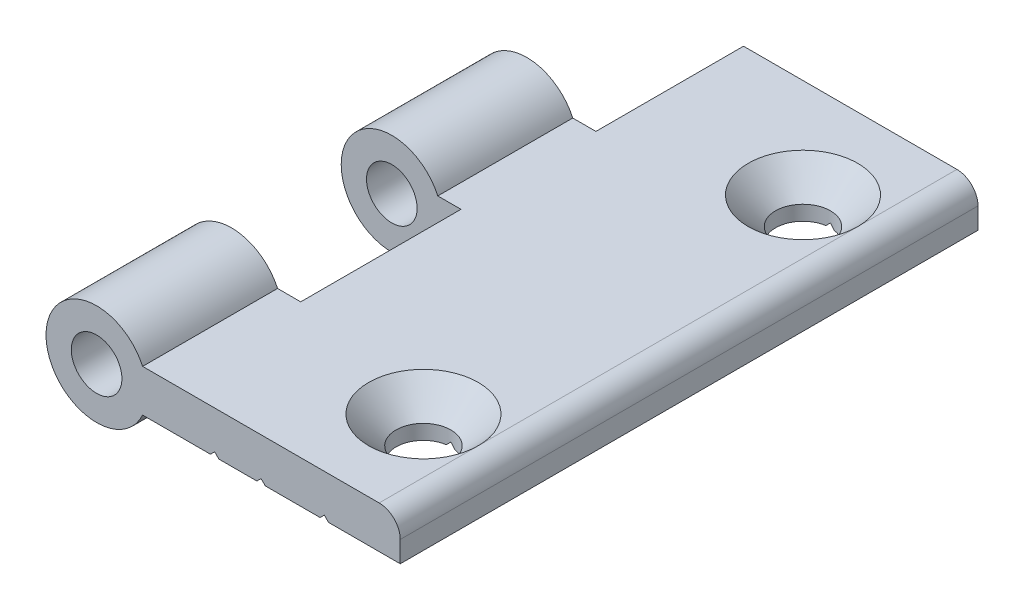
ISO-10303-21;
HEADER;
FILE_DESCRIPTION(('STEP AP214'),'2;1');
FILE_NAME('part.step','',(''),(''),'','','');
FILE_SCHEMA(('AUTOMOTIVE_DESIGN { 1 0 10303 214 1 1 1 1 }'));
ENDSEC;
DATA;
#1=APPLICATION_CONTEXT('core data for automotive mechanical design processes');
#2=APPLICATION_PROTOCOL_DEFINITION('international standard','automotive_design',2000,#1);
#3=PRODUCT_CONTEXT('',#1,'mechanical');
#4=PRODUCT('Part','Part','',(#3));
#5=PRODUCT_RELATED_PRODUCT_CATEGORY('part','',(#4));
#6=PRODUCT_DEFINITION_FORMATION('','',#4);
#7=PRODUCT_DEFINITION_CONTEXT('part definition',#1,'design');
#8=PRODUCT_DEFINITION('design','',#6,#7);
#9=PRODUCT_DEFINITION_SHAPE('','',#8);
#10=(LENGTH_UNIT() NAMED_UNIT(*) SI_UNIT(.MILLI.,.METRE.));
#11=(NAMED_UNIT(*) PLANE_ANGLE_UNIT() SI_UNIT($,.RADIAN.));
#12=(NAMED_UNIT(*) SI_UNIT($,.STERADIAN.) SOLID_ANGLE_UNIT());
#13=UNCERTAINTY_MEASURE_WITH_UNIT(LENGTH_MEASURE(1.E-05),#10,'distance_accuracy_value','');
#14=(GEOMETRIC_REPRESENTATION_CONTEXT(3) GLOBAL_UNCERTAINTY_ASSIGNED_CONTEXT((#13)) GLOBAL_UNIT_ASSIGNED_CONTEXT((#10,
#11,#12)) REPRESENTATION_CONTEXT('',''));
#15=CARTESIAN_POINT('',(0.,0.,0.));
#16=DIRECTION('',(0.,0.,1.));
#17=DIRECTION('',(1.,0.,0.));
#18=AXIS2_PLACEMENT_3D('',#15,#16,#17);
#19=CARTESIAN_POINT('',(27.,2.5,11.75));
#20=DIRECTION('',(0.,1.,0.));
#21=DIRECTION('',(-1.,0.,0.));
#22=AXIS2_PLACEMENT_3D('',#19,#20,#21);
#23=CONICAL_SURFACE('',#22,6.5,0.785398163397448);
#24=CARTESIAN_POINT('',(27.,-0.750000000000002,11.75));
#25=DIRECTION('',(0.,1.,0.));
#26=DIRECTION('',(0.,0.,1.));
#27=AXIS2_PLACEMENT_3D('',#24,#25,#26);
#28=CIRCLE('',#27,3.25);
#29=CARTESIAN_POINT('',(27.,-0.750000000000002,15.));
#30=VERTEX_POINT('',#29);
#31=EDGE_CURVE('E234',#30,#30,#28,.T.);
#32=ORIENTED_EDGE('',*,*,#31,.F.);
#33=EDGE_LOOP('',(#32));
#34=FACE_BOUND('',#33,.T.);
#35=CARTESIAN_POINT('',(27.,2.5,11.75));
#36=DIRECTION('',(0.,1.,0.));
#37=DIRECTION('',(-1.,0.,0.));
#38=AXIS2_PLACEMENT_3D('',#35,#36,#37);
#39=CIRCLE('',#38,6.5);
#40=CARTESIAN_POINT('',(33.5,2.5,11.75));
#41=VERTEX_POINT('',#40);
#42=EDGE_CURVE('E255',#41,#41,#39,.T.);
#43=ORIENTED_EDGE('',*,*,#42,.T.);
#44=EDGE_LOOP('',(#43));
#45=FACE_BOUND('',#44,.T.);
#46=ADVANCED_FACE('F15',(#34,#45),#23,.F.);
#47=CARTESIAN_POINT('',(27.,-0.75,11.75));
#48=DIRECTION('',(0.,-1.,0.));
#49=DIRECTION('',(0.,0.,-1.));
#50=AXIS2_PLACEMENT_3D('',#47,#48,#49);
#51=CYLINDRICAL_SURFACE('',#50,3.25);
#52=ORIENTED_EDGE('',*,*,#31,.T.);
#53=EDGE_LOOP('',(#52));
#54=FACE_BOUND('',#53,.T.);
#55=CARTESIAN_POINT('',(27.,-1.99999999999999,11.75));
#56=DIRECTION('',(-0.707106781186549,-0.707106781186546,0.));
#57=DIRECTION('',(0.707106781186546,-0.707106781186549,0.));
#58=AXIS2_PLACEMENT_3D('',#55,#56,#57);
#59=ELLIPSE('',#58,4.59619407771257,3.25);
#60=CARTESIAN_POINT('',(27.,-2.,15.));
#61=VERTEX_POINT('',#60);
#62=CARTESIAN_POINT('',(27.5,-2.5,14.9613081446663));
#63=VERTEX_POINT('',#62);
#64=EDGE_CURVE('E222',#61,#63,#59,.F.);
#65=ORIENTED_EDGE('',*,*,#64,.F.);
#66=CARTESIAN_POINT('',(27.,-2.,11.75));
#67=DIRECTION('',(0.707106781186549,-0.707106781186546,0.));
#68=DIRECTION('',(-0.707106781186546,-0.707106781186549,0.));
#69=AXIS2_PLACEMENT_3D('',#66,#67,#68);
#70=ELLIPSE('',#69,4.59619407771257,3.25);
#71=CARTESIAN_POINT('',(26.5,-2.5,14.9613081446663));
#72=VERTEX_POINT('',#71);
#73=EDGE_CURVE('E225',#72,#61,#70,.F.);
#74=ORIENTED_EDGE('',*,*,#73,.F.);
#75=CARTESIAN_POINT('',(27.,-2.5,11.75));
#76=DIRECTION('',(0.,-1.,0.));
#77=DIRECTION('',(0.,0.,-1.));
#78=AXIS2_PLACEMENT_3D('',#75,#76,#77);
#79=CIRCLE('',#78,3.25);
#80=CARTESIAN_POINT('',(26.5,-2.5,8.53869185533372));
#81=VERTEX_POINT('',#80);
#82=EDGE_CURVE('E245',#81,#72,#79,.F.);
#83=ORIENTED_EDGE('',*,*,#82,.F.);
#84=CARTESIAN_POINT('',(27.,-2.,11.75));
#85=DIRECTION('',(0.707106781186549,-0.707106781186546,0.));
#86=DIRECTION('',(-0.707106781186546,-0.707106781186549,0.));
#87=AXIS2_PLACEMENT_3D('',#84,#85,#86);
#88=ELLIPSE('',#87,4.59619407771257,3.25);
#89=CARTESIAN_POINT('',(27.,-2.,8.5));
#90=VERTEX_POINT('',#89);
#91=EDGE_CURVE('E397',#90,#81,#88,.F.);
#92=ORIENTED_EDGE('',*,*,#91,.F.);
#93=CARTESIAN_POINT('',(27.,-1.99999999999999,11.75));
#94=DIRECTION('',(-0.707106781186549,-0.707106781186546,0.));
#95=DIRECTION('',(0.707106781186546,-0.707106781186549,0.));
#96=AXIS2_PLACEMENT_3D('',#93,#94,#95);
#97=ELLIPSE('',#96,4.59619407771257,3.25);
#98=CARTESIAN_POINT('',(27.5,-2.5,8.53869185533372));
#99=VERTEX_POINT('',#98);
#100=EDGE_CURVE('E400',#99,#90,#97,.F.);
#101=ORIENTED_EDGE('',*,*,#100,.F.);
#102=CARTESIAN_POINT('',(27.,-2.5,11.75));
#103=DIRECTION('',(0.,-1.,0.));
#104=DIRECTION('',(0.,0.,-1.));
#105=AXIS2_PLACEMENT_3D('',#102,#103,#104);
#106=CIRCLE('',#105,3.25);
#107=EDGE_CURVE('E228',#63,#99,#106,.F.);
#108=ORIENTED_EDGE('',*,*,#107,.F.);
#109=EDGE_LOOP('',(#65,#74,#83,#92,#101,#108));
#110=FACE_BOUND('',#109,.T.);
#111=ADVANCED_FACE('F224',(#54,#110),#51,.F.);
#112=CARTESIAN_POINT('',(27.,2.5,56.75));
#113=DIRECTION('',(0.,1.,0.));
#114=DIRECTION('',(-1.,0.,0.));
#115=AXIS2_PLACEMENT_3D('',#112,#113,#114);
#116=CONICAL_SURFACE('',#115,6.50000000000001,0.785398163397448);
#117=CARTESIAN_POINT('',(27.,-0.750000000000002,56.75));
#118=DIRECTION('',(0.,1.,0.));
#119=DIRECTION('',(-1.,0.,0.));
#120=AXIS2_PLACEMENT_3D('',#117,#118,#119);
#121=CIRCLE('',#120,3.25);
#122=CARTESIAN_POINT('',(23.75,-0.750000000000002,56.75));
#123=VERTEX_POINT('',#122);
#124=EDGE_CURVE('E404',#123,#123,#121,.T.);
#125=ORIENTED_EDGE('',*,*,#124,.F.);
#126=EDGE_LOOP('',(#125));
#127=FACE_BOUND('',#126,.T.);
#128=CARTESIAN_POINT('',(27.,2.49999999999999,56.75));
#129=DIRECTION('',(0.,1.,0.));
#130=DIRECTION('',(-1.,0.,0.));
#131=AXIS2_PLACEMENT_3D('',#128,#129,#130);
#132=CIRCLE('',#131,6.5);
#133=CARTESIAN_POINT('',(33.5,2.5,56.75));
#134=VERTEX_POINT('',#133);
#135=EDGE_CURVE('E10',#134,#134,#132,.T.);
#136=ORIENTED_EDGE('',*,*,#135,.T.);
#137=EDGE_LOOP('',(#136));
#138=FACE_BOUND('',#137,.T.);
#139=ADVANCED_FACE('F359',(#127,#138),#116,.F.);
#140=CARTESIAN_POINT('',(27.,-0.75,56.75));
#141=DIRECTION('',(0.,-1.,0.));
#142=DIRECTION('',(0.,0.,-1.));
#143=AXIS2_PLACEMENT_3D('',#140,#141,#142);
#144=CYLINDRICAL_SURFACE('',#143,3.25);
#145=ORIENTED_EDGE('',*,*,#124,.T.);
#146=EDGE_LOOP('',(#145));
#147=FACE_BOUND('',#146,.T.);
#148=CARTESIAN_POINT('',(27.,-1.99999999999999,56.75));
#149=DIRECTION('',(-0.707106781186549,-0.707106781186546,0.));
#150=DIRECTION('',(0.707106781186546,-0.707106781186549,0.));
#151=AXIS2_PLACEMENT_3D('',#148,#149,#150);
#152=ELLIPSE('',#151,4.59619407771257,3.25);
#153=CARTESIAN_POINT('',(27.,-2.,60.));
#154=VERTEX_POINT('',#153);
#155=CARTESIAN_POINT('',(27.5,-2.5,59.9613081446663));
#156=VERTEX_POINT('',#155);
#157=EDGE_CURVE('E408',#154,#156,#152,.F.);
#158=ORIENTED_EDGE('',*,*,#157,.F.);
#159=CARTESIAN_POINT('',(27.,-2.,56.75));
#160=DIRECTION('',(0.707106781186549,-0.707106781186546,0.));
#161=DIRECTION('',(-0.707106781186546,-0.707106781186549,0.));
#162=AXIS2_PLACEMENT_3D('',#159,#160,#161);
#163=ELLIPSE('',#162,4.59619407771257,3.25);
#164=CARTESIAN_POINT('',(26.5,-2.5,59.9613081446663));
#165=VERTEX_POINT('',#164);
#166=EDGE_CURVE('E413',#165,#154,#163,.F.);
#167=ORIENTED_EDGE('',*,*,#166,.F.);
#168=CARTESIAN_POINT('',(27.,-2.5,56.75));
#169=DIRECTION('',(0.,-1.,0.));
#170=DIRECTION('',(0.,0.,-1.));
#171=AXIS2_PLACEMENT_3D('',#168,#169,#170);
#172=CIRCLE('',#171,3.25);
#173=CARTESIAN_POINT('',(26.5,-2.5,53.5386918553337));
#174=VERTEX_POINT('',#173);
#175=EDGE_CURVE('E417',#174,#165,#172,.F.);
#176=ORIENTED_EDGE('',*,*,#175,.F.);
#177=CARTESIAN_POINT('',(27.,-2.,56.75));
#178=DIRECTION('',(0.707106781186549,-0.707106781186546,0.));
#179=DIRECTION('',(-0.707106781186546,-0.707106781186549,0.));
#180=AXIS2_PLACEMENT_3D('',#177,#178,#179);
#181=ELLIPSE('',#180,4.59619407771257,3.25);
#182=CARTESIAN_POINT('',(27.,-2.,53.5));
#183=VERTEX_POINT('',#182);
#184=EDGE_CURVE('E421',#183,#174,#181,.F.);
#185=ORIENTED_EDGE('',*,*,#184,.F.);
#186=CARTESIAN_POINT('',(27.,-1.99999999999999,56.75));
#187=DIRECTION('',(-0.707106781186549,-0.707106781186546,0.));
#188=DIRECTION('',(0.707106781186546,-0.707106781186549,0.));
#189=AXIS2_PLACEMENT_3D('',#186,#187,#188);
#190=ELLIPSE('',#189,4.59619407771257,3.25);
#191=CARTESIAN_POINT('',(27.5,-2.5,53.5386918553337));
#192=VERTEX_POINT('',#191);
#193=EDGE_CURVE('E248',#192,#183,#190,.F.);
#194=ORIENTED_EDGE('',*,*,#193,.F.);
#195=CARTESIAN_POINT('',(27.,-2.5,56.75));
#196=DIRECTION('',(0.,-1.,0.));
#197=DIRECTION('',(0.,0.,-1.));
#198=AXIS2_PLACEMENT_3D('',#195,#196,#197);
#199=CIRCLE('',#198,3.25);
#200=EDGE_CURVE('E309',#156,#192,#199,.F.);
#201=ORIENTED_EDGE('',*,*,#200,.F.);
#202=EDGE_LOOP('',(#158,#167,#176,#185,#194,#201));
#203=FACE_BOUND('',#202,.T.);
#204=ADVANCED_FACE('F361',(#147,#203),#144,.F.);
#205=CARTESIAN_POINT('',(14.3886766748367,-0.053688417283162,0.));
#206=DIRECTION('',(0.,0.,1.));
#207=DIRECTION('',(1.,0.,0.));
#208=AXIS2_PLACEMENT_3D('',#205,#206,#207);
#209=PLANE('',#208);
#210=DIRECTION('',(1.,0.,0.));
#211=VECTOR('',#210,1.);
#212=CARTESIAN_POINT('',(20.85,2.5,0.));
#213=LINE('',#212,#211);
#214=CARTESIAN_POINT('',(8.19999999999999,2.5,0.));
#215=VERTEX_POINT('',#214);
#216=CARTESIAN_POINT('',(33.4999998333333,2.5,0.));
#217=VERTEX_POINT('',#216);
#218=EDGE_CURVE('E347',#215,#217,#213,.T.);
#219=ORIENTED_EDGE('',*,*,#218,.T.);
#220=CARTESIAN_POINT('',(33.5,0.,0.));
#221=DIRECTION('',(0.,0.,1.));
#222=DIRECTION('',(1.,0.,0.));
#223=AXIS2_PLACEMENT_3D('',#220,#221,#222);
#224=CIRCLE('',#223,2.5);
#225=CARTESIAN_POINT('',(36.,0.,0.));
#226=VERTEX_POINT('',#225);
#227=EDGE_CURVE('E306',#226,#217,#224,.T.);
#228=ORIENTED_EDGE('',*,*,#227,.F.);
#229=DIRECTION('',(0.,1.,0.));
#230=VECTOR('',#229,1.);
#231=CARTESIAN_POINT('',(36.,-0.053688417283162,0.));
#232=LINE('',#231,#230);
#233=CARTESIAN_POINT('',(36.,-2.5,0.));
#234=VERTEX_POINT('',#233);
#235=EDGE_CURVE('E308',#234,#226,#232,.T.);
#236=ORIENTED_EDGE('',*,*,#235,.F.);
#237=DIRECTION('',(1.,0.,0.));
#238=VECTOR('',#237,1.);
#239=CARTESIAN_POINT('',(14.3886766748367,-2.5,0.));
#240=LINE('',#239,#238);
#241=CARTESIAN_POINT('',(27.5,-2.5,0.));
#242=VERTEX_POINT('',#241);
#243=EDGE_CURVE('E431',#242,#234,#240,.T.);
#244=ORIENTED_EDGE('',*,*,#243,.F.);
#245=DIRECTION('',(0.707106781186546,-0.707106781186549,0.));
#246=VECTOR('',#245,1.);
#247=CARTESIAN_POINT('',(27.5,-2.5,0.));
#248=LINE('',#247,#246);
#249=CARTESIAN_POINT('',(27.,-2.,0.));
#250=VERTEX_POINT('',#249);
#251=EDGE_CURVE('E435',#250,#242,#248,.T.);
#252=ORIENTED_EDGE('',*,*,#251,.F.);
#253=DIRECTION('',(0.707106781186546,0.707106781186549,0.));
#254=VECTOR('',#253,1.);
#255=CARTESIAN_POINT('',(27.,-2.,0.));
#256=LINE('',#255,#254);
#257=CARTESIAN_POINT('',(26.5,-2.5,0.));
#258=VERTEX_POINT('',#257);
#259=EDGE_CURVE('E438',#258,#250,#256,.T.);
#260=ORIENTED_EDGE('',*,*,#259,.F.);
#261=DIRECTION('',(1.,0.,0.));
#262=VECTOR('',#261,1.);
#263=CARTESIAN_POINT('',(14.3886766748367,-2.5,0.));
#264=LINE('',#263,#262);
#265=CARTESIAN_POINT('',(20.,-2.5,0.));
#266=VERTEX_POINT('',#265);
#267=EDGE_CURVE('E441',#266,#258,#264,.T.);
#268=ORIENTED_EDGE('',*,*,#267,.F.);
#269=DIRECTION('',(0.707106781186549,-0.707106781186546,0.));
#270=VECTOR('',#269,1.);
#271=CARTESIAN_POINT('',(20.,-2.5,0.));
#272=LINE('',#271,#270);
#273=CARTESIAN_POINT('',(19.5,-2.,0.));
#274=VERTEX_POINT('',#273);
#275=EDGE_CURVE('E444',#274,#266,#272,.T.);
#276=ORIENTED_EDGE('',*,*,#275,.F.);
#277=DIRECTION('',(0.707106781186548,0.707106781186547,0.));
#278=VECTOR('',#277,1.);
#279=CARTESIAN_POINT('',(19.5,-2.,0.));
#280=LINE('',#279,#278);
#281=CARTESIAN_POINT('',(19.,-2.5,0.));
#282=VERTEX_POINT('',#281);
#283=EDGE_CURVE('E448',#282,#274,#280,.T.);
#284=ORIENTED_EDGE('',*,*,#283,.F.);
#285=DIRECTION('',(1.,0.,0.));
#286=VECTOR('',#285,1.);
#287=CARTESIAN_POINT('',(14.3886766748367,-2.5,0.));
#288=LINE('',#287,#286);
#289=CARTESIAN_POINT('',(14.5,-2.5,0.));
#290=VERTEX_POINT('',#289);
#291=EDGE_CURVE('E452',#290,#282,#288,.T.);
#292=ORIENTED_EDGE('',*,*,#291,.F.);
#293=DIRECTION('',(0.707106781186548,-0.707106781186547,0.));
#294=VECTOR('',#293,1.);
#295=CARTESIAN_POINT('',(14.5,-2.5,0.));
#296=LINE('',#295,#294);
#297=CARTESIAN_POINT('',(14.,-2.,0.));
#298=VERTEX_POINT('',#297);
#299=EDGE_CURVE('E455',#298,#290,#296,.T.);
#300=ORIENTED_EDGE('',*,*,#299,.F.);
#301=DIRECTION('',(0.707106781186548,0.707106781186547,0.));
#302=VECTOR('',#301,1.);
#303=CARTESIAN_POINT('',(14.,-2.,0.));
#304=LINE('',#303,#302);
#305=CARTESIAN_POINT('',(13.5,-2.5,0.));
#306=VERTEX_POINT('',#305);
#307=EDGE_CURVE('E459',#306,#298,#304,.T.);
#308=ORIENTED_EDGE('',*,*,#307,.F.);
#309=DIRECTION('',(1.,0.,0.));
#310=VECTOR('',#309,1.);
#311=CARTESIAN_POINT('',(14.3886766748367,-2.5,0.));
#312=LINE('',#311,#310);
#313=CARTESIAN_POINT('',(8.19999999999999,-2.5,0.));
#314=VERTEX_POINT('',#313);
#315=EDGE_CURVE('E305',#314,#306,#312,.T.);
#316=ORIENTED_EDGE('',*,*,#315,.F.);
#317=DIRECTION('',(0.,1.,0.));
#318=VECTOR('',#317,1.);
#319=CARTESIAN_POINT('',(8.19999999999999,-0.053688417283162,0.));
#320=LINE('',#319,#318);
#321=EDGE_CURVE('E265',#215,#314,#320,.F.);
#322=ORIENTED_EDGE('',*,*,#321,.F.);
#323=EDGE_LOOP('',(#219,#228,#236,#244,#252,#260,#268,#276,#284,#292,#300,#308,#316,#322));
#324=FACE_BOUND('',#323,.T.);
#325=ADVANCED_FACE('F368',(#324),#209,.F.);
#326=CARTESIAN_POINT('',(33.5,0.,0.));
#327=DIRECTION('',(0.,0.,1.));
#328=DIRECTION('',(1.,0.,0.));
#329=AXIS2_PLACEMENT_3D('',#326,#327,#328);
#330=CYLINDRICAL_SURFACE('',#329,2.5);
#331=ORIENTED_EDGE('',*,*,#227,.T.);
#332=DIRECTION('',(0.,0.,1.));
#333=VECTOR('',#332,1.);
#334=CARTESIAN_POINT('',(33.5,2.5,34.25));
#335=LINE('',#334,#333);
#336=EDGE_CURVE('E314',#217,#41,#335,.T.);
#337=ORIENTED_EDGE('',*,*,#336,.T.);
#338=DIRECTION('',(0.,0.,1.));
#339=VECTOR('',#338,1.);
#340=CARTESIAN_POINT('',(33.5,2.5,34.25));
#341=LINE('',#340,#339);
#342=EDGE_CURVE('E19',#41,#134,#341,.T.);
#343=ORIENTED_EDGE('',*,*,#342,.T.);
#344=DIRECTION('',(0.,0.,1.));
#345=VECTOR('',#344,1.);
#346=CARTESIAN_POINT('',(33.5,2.5,34.25));
#347=LINE('',#346,#345);
#348=CARTESIAN_POINT('',(33.5,2.5,68.4999998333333));
#349=VERTEX_POINT('',#348);
#350=EDGE_CURVE('E26',#134,#349,#347,.T.);
#351=ORIENTED_EDGE('',*,*,#350,.T.);
#352=CARTESIAN_POINT('',(33.5,0.,68.5));
#353=DIRECTION('',(0.,0.,1.));
#354=DIRECTION('',(1.,0.,0.));
#355=AXIS2_PLACEMENT_3D('',#352,#353,#354);
#356=CIRCLE('',#355,2.5);
#357=CARTESIAN_POINT('',(36.,0.,68.5));
#358=VERTEX_POINT('',#357);
#359=EDGE_CURVE('E261',#349,#358,#356,.F.);
#360=ORIENTED_EDGE('',*,*,#359,.T.);
#361=DIRECTION('',(0.,0.,1.));
#362=VECTOR('',#361,1.);
#363=CARTESIAN_POINT('',(36.,0.,0.));
#364=LINE('',#363,#362);
#365=EDGE_CURVE('E264',#358,#226,#364,.F.);
#366=ORIENTED_EDGE('',*,*,#365,.T.);
#367=EDGE_LOOP('',(#331,#337,#343,#351,#360,#366));
#368=FACE_BOUND('',#367,.T.);
#369=ADVANCED_FACE('F350',(#368),#330,.T.);
#370=CARTESIAN_POINT('',(14.3886766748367,-0.053688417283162,68.5));
#371=DIRECTION('',(0.,0.,1.));
#372=DIRECTION('',(1.,0.,0.));
#373=AXIS2_PLACEMENT_3D('',#370,#371,#372);
#374=PLANE('',#373);
#375=CARTESIAN_POINT('',(0.,0.,68.5));
#376=DIRECTION('',(0.,0.,1.));
#377=DIRECTION('',(1.,0.,0.));
#378=AXIS2_PLACEMENT_3D('',#375,#376,#377);
#379=CIRCLE('',#378,3.);
#380=CARTESIAN_POINT('',(3.,0.,68.5));
#381=VERTEX_POINT('',#380);
#382=EDGE_CURVE('E467',#381,#381,#379,.F.);
#383=ORIENTED_EDGE('',*,*,#382,.T.);
#384=EDGE_LOOP('',(#383));
#385=FACE_BOUND('',#384,.T.);
#386=DIRECTION('',(0.,1.,0.));
#387=VECTOR('',#386,1.);
#388=CARTESIAN_POINT('',(36.,-0.053688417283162,68.5));
#389=LINE('',#388,#387);
#390=CARTESIAN_POINT('',(36.,-2.5,68.5));
#391=VERTEX_POINT('',#390);
#392=EDGE_CURVE('E269',#391,#358,#389,.T.);
#393=ORIENTED_EDGE('',*,*,#392,.T.);
#394=ORIENTED_EDGE('',*,*,#359,.F.);
#395=DIRECTION('',(1.,0.,0.));
#396=VECTOR('',#395,1.);
#397=CARTESIAN_POINT('',(19.4771780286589,2.5,68.5));
#398=LINE('',#397,#396);
#399=CARTESIAN_POINT('',(5.45435605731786,2.5,68.4999998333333));
#400=VERTEX_POINT('',#399);
#401=EDGE_CURVE('E317',#400,#349,#398,.T.);
#402=ORIENTED_EDGE('',*,*,#401,.F.);
#403=CARTESIAN_POINT('',(0.,0.,68.5));
#404=DIRECTION('',(0.,0.,1.));
#405=DIRECTION('',(1.,0.,0.));
#406=AXIS2_PLACEMENT_3D('',#403,#404,#405);
#407=CIRCLE('',#406,6.);
#408=CARTESIAN_POINT('',(5.45435605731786,-2.5,68.5));
#409=VERTEX_POINT('',#408);
#410=EDGE_CURVE('E266',#400,#409,#407,.T.);
#411=ORIENTED_EDGE('',*,*,#410,.T.);
#412=DIRECTION('',(1.,0.,0.));
#413=VECTOR('',#412,1.);
#414=CARTESIAN_POINT('',(14.3886766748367,-2.5,68.5));
#415=LINE('',#414,#413);
#416=CARTESIAN_POINT('',(13.5,-2.5,68.5));
#417=VERTEX_POINT('',#416);
#418=EDGE_CURVE('E268',#409,#417,#415,.T.);
#419=ORIENTED_EDGE('',*,*,#418,.T.);
#420=DIRECTION('',(0.707106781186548,0.707106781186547,0.));
#421=VECTOR('',#420,1.);
#422=CARTESIAN_POINT('',(14.,-2.,68.5));
#423=LINE('',#422,#421);
#424=CARTESIAN_POINT('',(14.,-2.,68.5));
#425=VERTEX_POINT('',#424);
#426=EDGE_CURVE('E476',#425,#417,#423,.F.);
#427=ORIENTED_EDGE('',*,*,#426,.F.);
#428=DIRECTION('',(0.707106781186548,-0.707106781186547,0.));
#429=VECTOR('',#428,1.);
#430=CARTESIAN_POINT('',(14.5,-2.5,68.5));
#431=LINE('',#430,#429);
#432=CARTESIAN_POINT('',(14.5,-2.5,68.5));
#433=VERTEX_POINT('',#432);
#434=EDGE_CURVE('E479',#433,#425,#431,.F.);
#435=ORIENTED_EDGE('',*,*,#434,.F.);
#436=DIRECTION('',(1.,0.,0.));
#437=VECTOR('',#436,1.);
#438=CARTESIAN_POINT('',(14.3886766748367,-2.5,68.5));
#439=LINE('',#438,#437);
#440=CARTESIAN_POINT('',(19.,-2.5,68.5));
#441=VERTEX_POINT('',#440);
#442=EDGE_CURVE('E482',#433,#441,#439,.T.);
#443=ORIENTED_EDGE('',*,*,#442,.T.);
#444=DIRECTION('',(0.707106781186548,0.707106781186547,0.));
#445=VECTOR('',#444,1.);
#446=CARTESIAN_POINT('',(19.5,-2.,68.5));
#447=LINE('',#446,#445);
#448=CARTESIAN_POINT('',(19.5,-2.,68.5));
#449=VERTEX_POINT('',#448);
#450=EDGE_CURVE('E484',#449,#441,#447,.F.);
#451=ORIENTED_EDGE('',*,*,#450,.F.);
#452=DIRECTION('',(0.707106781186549,-0.707106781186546,0.));
#453=VECTOR('',#452,1.);
#454=CARTESIAN_POINT('',(20.,-2.5,68.5));
#455=LINE('',#454,#453);
#456=CARTESIAN_POINT('',(20.,-2.5,68.5));
#457=VERTEX_POINT('',#456);
#458=EDGE_CURVE('E487',#457,#449,#455,.F.);
#459=ORIENTED_EDGE('',*,*,#458,.F.);
#460=DIRECTION('',(1.,0.,0.));
#461=VECTOR('',#460,1.);
#462=CARTESIAN_POINT('',(14.3886766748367,-2.5,68.5));
#463=LINE('',#462,#461);
#464=CARTESIAN_POINT('',(26.5,-2.5,68.5));
#465=VERTEX_POINT('',#464);
#466=EDGE_CURVE('E490',#457,#465,#463,.T.);
#467=ORIENTED_EDGE('',*,*,#466,.T.);
#468=DIRECTION('',(0.707106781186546,0.707106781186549,0.));
#469=VECTOR('',#468,1.);
#470=CARTESIAN_POINT('',(27.,-2.,68.5));
#471=LINE('',#470,#469);
#472=CARTESIAN_POINT('',(27.,-2.,68.5));
#473=VERTEX_POINT('',#472);
#474=EDGE_CURVE('E493',#473,#465,#471,.F.);
#475=ORIENTED_EDGE('',*,*,#474,.F.);
#476=DIRECTION('',(0.707106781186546,-0.707106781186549,0.));
#477=VECTOR('',#476,1.);
#478=CARTESIAN_POINT('',(27.5,-2.5,68.5));
#479=LINE('',#478,#477);
#480=CARTESIAN_POINT('',(27.5,-2.5,68.5));
#481=VERTEX_POINT('',#480);
#482=EDGE_CURVE('E497',#481,#473,#479,.F.);
#483=ORIENTED_EDGE('',*,*,#482,.F.);
#484=DIRECTION('',(1.,0.,0.));
#485=VECTOR('',#484,1.);
#486=CARTESIAN_POINT('',(14.3886766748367,-2.5,68.5));
#487=LINE('',#486,#485);
#488=EDGE_CURVE('E274',#481,#391,#487,.T.);
#489=ORIENTED_EDGE('',*,*,#488,.T.);
#490=EDGE_LOOP('',(#393,#394,#402,#411,#419,#427,#435,#443,#451,#459,#467,#475,#483,#489));
#491=FACE_BOUND('',#490,.T.);
#492=ADVANCED_FACE('F630',(#385,#491),#374,.T.);
#493=CARTESIAN_POINT('',(0.,0.,0.));
#494=DIRECTION('',(0.,0.,1.));
#495=DIRECTION('',(1.,0.,0.));
#496=AXIS2_PLACEMENT_3D('',#493,#494,#495);
#497=CYLINDRICAL_SURFACE('',#496,6.);
#498=ORIENTED_EDGE('',*,*,#410,.F.);
#499=DIRECTION('',(0.,0.,1.));
#500=VECTOR('',#499,1.);
#501=CARTESIAN_POINT('',(5.45435605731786,2.5,60.5));
#502=LINE('',#501,#500);
#503=CARTESIAN_POINT('',(5.45435605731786,2.5,52.5));
#504=VERTEX_POINT('',#503);
#505=EDGE_CURVE('E321',#504,#400,#502,.T.);
#506=ORIENTED_EDGE('',*,*,#505,.F.);
#507=CARTESIAN_POINT('',(0.,0.,52.5));
#508=DIRECTION('',(0.,0.,1.));
#509=DIRECTION('',(1.,0.,0.));
#510=AXIS2_PLACEMENT_3D('',#507,#508,#509);
#511=CIRCLE('',#510,6.);
#512=CARTESIAN_POINT('',(5.45435605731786,-2.5,52.5));
#513=VERTEX_POINT('',#512);
#514=EDGE_CURVE('E270',#504,#513,#511,.T.);
#515=ORIENTED_EDGE('',*,*,#514,.T.);
#516=DIRECTION('',(0.,0.,1.));
#517=VECTOR('',#516,1.);
#518=CARTESIAN_POINT('',(5.45435605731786,-2.5,0.));
#519=LINE('',#518,#517);
#520=EDGE_CURVE('E273',#513,#409,#519,.T.);
#521=ORIENTED_EDGE('',*,*,#520,.T.);
#522=EDGE_LOOP('',(#498,#506,#515,#521));
#523=FACE_BOUND('',#522,.T.);
#524=ADVANCED_FACE('F635',(#523),#497,.T.);
#525=CARTESIAN_POINT('',(-31.8462170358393,2.5,52.5));
#526=DIRECTION('',(0.,0.,1.));
#527=DIRECTION('',(1.,0.,0.));
#528=AXIS2_PLACEMENT_3D('',#525,#526,#527);
#529=PLANE('',#528);
#530=CARTESIAN_POINT('',(0.,0.,52.5));
#531=DIRECTION('',(0.,0.,1.));
#532=DIRECTION('',(1.,0.,0.));
#533=AXIS2_PLACEMENT_3D('',#530,#531,#532);
#534=CIRCLE('',#533,3.);
#535=CARTESIAN_POINT('',(3.,0.,52.5));
#536=VERTEX_POINT('',#535);
#537=EDGE_CURVE('E280',#536,#536,#534,.F.);
#538=ORIENTED_EDGE('',*,*,#537,.F.);
#539=EDGE_LOOP('',(#538));
#540=FACE_BOUND('',#539,.T.);
#541=DIRECTION('',(0.,1.,0.));
#542=VECTOR('',#541,1.);
#543=CARTESIAN_POINT('',(8.2,2.5,52.5));
#544=LINE('',#543,#542);
#545=CARTESIAN_POINT('',(8.2,-2.5,52.5));
#546=VERTEX_POINT('',#545);
#547=CARTESIAN_POINT('',(8.19999983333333,2.5,52.5));
#548=VERTEX_POINT('',#547);
#549=EDGE_CURVE('E275',#546,#548,#544,.T.);
#550=ORIENTED_EDGE('',*,*,#549,.F.);
#551=DIRECTION('',(1.,0.,0.));
#552=VECTOR('',#551,1.);
#553=CARTESIAN_POINT('',(-31.8462170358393,-2.5,52.5));
#554=LINE('',#553,#552);
#555=EDGE_CURVE('E279',#513,#546,#554,.T.);
#556=ORIENTED_EDGE('',*,*,#555,.F.);
#557=ORIENTED_EDGE('',*,*,#514,.F.);
#558=DIRECTION('',(1.,0.,0.));
#559=VECTOR('',#558,1.);
#560=CARTESIAN_POINT('',(6.82717802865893,2.5,52.5));
#561=LINE('',#560,#559);
#562=EDGE_CURVE('E325',#504,#548,#561,.T.);
#563=ORIENTED_EDGE('',*,*,#562,.T.);
#564=EDGE_LOOP('',(#550,#556,#557,#563));
#565=FACE_BOUND('',#564,.T.);
#566=ADVANCED_FACE('F638',(#540,#565),#529,.F.);
#567=CARTESIAN_POINT('',(8.2,2.5,52.5));
#568=DIRECTION('',(1.,0.,0.));
#569=DIRECTION('',(0.,0.,-1.));
#570=AXIS2_PLACEMENT_3D('',#567,#568,#569);
#571=PLANE('',#570);
#572=DIRECTION('',(0.,1.,0.));
#573=VECTOR('',#572,1.);
#574=CARTESIAN_POINT('',(8.2,2.5,33.5));
#575=LINE('',#574,#573);
#576=CARTESIAN_POINT('',(8.2,-2.5,33.5));
#577=VERTEX_POINT('',#576);
#578=CARTESIAN_POINT('',(8.2,2.5,33.5));
#579=VERTEX_POINT('',#578);
#580=EDGE_CURVE('E281',#577,#579,#575,.T.);
#581=ORIENTED_EDGE('',*,*,#580,.F.);
#582=DIRECTION('',(0.,0.,-1.));
#583=VECTOR('',#582,1.);
#584=CARTESIAN_POINT('',(8.2,-2.5,52.5));
#585=LINE('',#584,#583);
#586=EDGE_CURVE('E285',#546,#577,#585,.T.);
#587=ORIENTED_EDGE('',*,*,#586,.F.);
#588=ORIENTED_EDGE('',*,*,#549,.T.);
#589=DIRECTION('',(0.,0.,1.));
#590=VECTOR('',#589,1.);
#591=CARTESIAN_POINT('',(8.2,2.5,43.));
#592=LINE('',#591,#590);
#593=EDGE_CURVE('E328',#579,#548,#592,.T.);
#594=ORIENTED_EDGE('',*,*,#593,.F.);
#595=EDGE_LOOP('',(#581,#587,#588,#594));
#596=FACE_BOUND('',#595,.T.);
#597=ADVANCED_FACE('F642',(#596),#571,.F.);
#598=CARTESIAN_POINT('',(8.2,2.5,33.5));
#599=DIRECTION('',(0.,0.,-1.));
#600=DIRECTION('',(-1.,0.,0.));
#601=AXIS2_PLACEMENT_3D('',#598,#599,#600);
#602=PLANE('',#601);
#603=CARTESIAN_POINT('',(0.,0.,33.5));
#604=DIRECTION('',(0.,0.,1.));
#605=DIRECTION('',(1.,0.,0.));
#606=AXIS2_PLACEMENT_3D('',#603,#604,#605);
#607=CIRCLE('',#606,3.);
#608=CARTESIAN_POINT('',(3.,0.,33.5));
#609=VERTEX_POINT('',#608);
#610=EDGE_CURVE('E291',#609,#609,#607,.T.);
#611=ORIENTED_EDGE('',*,*,#610,.F.);
#612=EDGE_LOOP('',(#611));
#613=FACE_BOUND('',#612,.T.);
#614=CARTESIAN_POINT('',(0.,0.,33.5));
#615=DIRECTION('',(0.,0.,1.));
#616=DIRECTION('',(1.,0.,0.));
#617=AXIS2_PLACEMENT_3D('',#614,#615,#616);
#618=CIRCLE('',#617,6.);
#619=CARTESIAN_POINT('',(5.45435605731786,-2.5,33.5));
#620=VERTEX_POINT('',#619);
#621=CARTESIAN_POINT('',(5.45435605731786,2.5,33.5));
#622=VERTEX_POINT('',#621);
#623=EDGE_CURVE('E286',#620,#622,#618,.F.);
#624=ORIENTED_EDGE('',*,*,#623,.F.);
#625=DIRECTION('',(-1.,0.,0.));
#626=VECTOR('',#625,1.);
#627=CARTESIAN_POINT('',(8.2,-2.5,33.5));
#628=LINE('',#627,#626);
#629=EDGE_CURVE('E290',#577,#620,#628,.T.);
#630=ORIENTED_EDGE('',*,*,#629,.F.);
#631=ORIENTED_EDGE('',*,*,#580,.T.);
#632=DIRECTION('',(1.,0.,0.));
#633=VECTOR('',#632,1.);
#634=CARTESIAN_POINT('',(6.82717802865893,2.5,33.5));
#635=LINE('',#634,#633);
#636=EDGE_CURVE('E332',#622,#579,#635,.T.);
#637=ORIENTED_EDGE('',*,*,#636,.F.);
#638=EDGE_LOOP('',(#624,#630,#631,#637));
#639=FACE_BOUND('',#638,.T.);
#640=ADVANCED_FACE('F644',(#613,#639),#602,.F.);
#641=CARTESIAN_POINT('',(0.,0.,0.));
#642=DIRECTION('',(0.,0.,1.));
#643=DIRECTION('',(1.,0.,0.));
#644=AXIS2_PLACEMENT_3D('',#641,#642,#643);
#645=CYLINDRICAL_SURFACE('',#644,6.);
#646=ORIENTED_EDGE('',*,*,#623,.T.);
#647=DIRECTION('',(0.,0.,1.));
#648=VECTOR('',#647,1.);
#649=CARTESIAN_POINT('',(5.45435605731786,2.5,25.5));
#650=LINE('',#649,#648);
#651=CARTESIAN_POINT('',(5.45435605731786,2.5,17.5));
#652=VERTEX_POINT('',#651);
#653=EDGE_CURVE('E336',#652,#622,#650,.T.);
#654=ORIENTED_EDGE('',*,*,#653,.F.);
#655=CARTESIAN_POINT('',(0.,0.,17.5));
#656=DIRECTION('',(0.,0.,1.));
#657=DIRECTION('',(1.,0.,0.));
#658=AXIS2_PLACEMENT_3D('',#655,#656,#657);
#659=CIRCLE('',#658,6.);
#660=CARTESIAN_POINT('',(5.45435605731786,-2.5,17.5));
#661=VERTEX_POINT('',#660);
#662=EDGE_CURVE('E292',#652,#661,#659,.T.);
#663=ORIENTED_EDGE('',*,*,#662,.T.);
#664=DIRECTION('',(0.,0.,1.));
#665=VECTOR('',#664,1.);
#666=CARTESIAN_POINT('',(5.45435605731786,-2.5,0.));
#667=LINE('',#666,#665);
#668=EDGE_CURVE('E295',#661,#620,#667,.T.);
#669=ORIENTED_EDGE('',*,*,#668,.T.);
#670=EDGE_LOOP('',(#646,#654,#663,#669));
#671=FACE_BOUND('',#670,.T.);
#672=ADVANCED_FACE('F647',(#671),#645,.T.);
#673=CARTESIAN_POINT('',(-54.1217168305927,2.5,17.5));
#674=DIRECTION('',(0.,0.,1.));
#675=DIRECTION('',(1.,0.,0.));
#676=AXIS2_PLACEMENT_3D('',#673,#674,#675);
#677=PLANE('',#676);
#678=CARTESIAN_POINT('',(0.,0.,17.5));
#679=DIRECTION('',(0.,0.,1.));
#680=DIRECTION('',(1.,0.,0.));
#681=AXIS2_PLACEMENT_3D('',#678,#679,#680);
#682=CIRCLE('',#681,3.);
#683=CARTESIAN_POINT('',(3.,0.,17.5));
#684=VERTEX_POINT('',#683);
#685=EDGE_CURVE('E301',#684,#684,#682,.F.);
#686=ORIENTED_EDGE('',*,*,#685,.F.);
#687=EDGE_LOOP('',(#686));
#688=FACE_BOUND('',#687,.T.);
#689=DIRECTION('',(0.,1.,0.));
#690=VECTOR('',#689,1.);
#691=CARTESIAN_POINT('',(8.19999999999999,2.5,17.5));
#692=LINE('',#691,#690);
#693=CARTESIAN_POINT('',(8.19999999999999,-2.5,17.5));
#694=VERTEX_POINT('',#693);
#695=CARTESIAN_POINT('',(8.19999983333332,2.5,17.5));
#696=VERTEX_POINT('',#695);
#697=EDGE_CURVE('E296',#694,#696,#692,.T.);
#698=ORIENTED_EDGE('',*,*,#697,.F.);
#699=DIRECTION('',(1.,0.,0.));
#700=VECTOR('',#699,1.);
#701=CARTESIAN_POINT('',(-54.1217168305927,-2.5,17.5));
#702=LINE('',#701,#700);
#703=EDGE_CURVE('E300',#661,#694,#702,.T.);
#704=ORIENTED_EDGE('',*,*,#703,.F.);
#705=ORIENTED_EDGE('',*,*,#662,.F.);
#706=DIRECTION('',(1.,0.,0.));
#707=VECTOR('',#706,1.);
#708=CARTESIAN_POINT('',(6.82717802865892,2.5,17.5));
#709=LINE('',#708,#707);
#710=EDGE_CURVE('E340',#652,#696,#709,.T.);
#711=ORIENTED_EDGE('',*,*,#710,.T.);
#712=EDGE_LOOP('',(#698,#704,#705,#711));
#713=FACE_BOUND('',#712,.T.);
#714=ADVANCED_FACE('F650',(#688,#713),#677,.F.);
#715=CARTESIAN_POINT('',(8.2,2.5,17.5));
#716=DIRECTION('',(1.,0.,0.));
#717=DIRECTION('',(0.,0.,-1.));
#718=AXIS2_PLACEMENT_3D('',#715,#716,#717);
#719=PLANE('',#718);
#720=ORIENTED_EDGE('',*,*,#321,.T.);
#721=DIRECTION('',(0.,0.,-1.));
#722=VECTOR('',#721,1.);
#723=CARTESIAN_POINT('',(8.2,-2.5,17.5));
#724=LINE('',#723,#722);
#725=EDGE_CURVE('E530',#694,#314,#724,.T.);
#726=ORIENTED_EDGE('',*,*,#725,.F.);
#727=ORIENTED_EDGE('',*,*,#697,.T.);
#728=DIRECTION('',(0.,0.,1.));
#729=VECTOR('',#728,1.);
#730=CARTESIAN_POINT('',(8.19999999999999,2.5,8.75));
#731=LINE('',#730,#729);
#732=EDGE_CURVE('E343',#215,#696,#731,.T.);
#733=ORIENTED_EDGE('',*,*,#732,.F.);
#734=EDGE_LOOP('',(#720,#726,#727,#733));
#735=FACE_BOUND('',#734,.T.);
#736=ADVANCED_FACE('F623',(#735),#719,.F.);
#737=CARTESIAN_POINT('',(13.5,-2.5,0.));
#738=DIRECTION('',(0.,-1.,0.));
#739=DIRECTION('',(0.,0.,-1.));
#740=AXIS2_PLACEMENT_3D('',#737,#738,#739);
#741=PLANE('',#740);
#742=ORIENTED_EDGE('',*,*,#668,.F.);
#743=ORIENTED_EDGE('',*,*,#703,.T.);
#744=ORIENTED_EDGE('',*,*,#725,.T.);
#745=ORIENTED_EDGE('',*,*,#315,.T.);
#746=DIRECTION('',(0.,0.,-1.));
#747=VECTOR('',#746,1.);
#748=CARTESIAN_POINT('',(13.5,-2.5,0.));
#749=LINE('',#748,#747);
#750=EDGE_CURVE('E534',#306,#417,#749,.F.);
#751=ORIENTED_EDGE('',*,*,#750,.T.);
#752=ORIENTED_EDGE('',*,*,#418,.F.);
#753=ORIENTED_EDGE('',*,*,#520,.F.);
#754=ORIENTED_EDGE('',*,*,#555,.T.);
#755=ORIENTED_EDGE('',*,*,#586,.T.);
#756=ORIENTED_EDGE('',*,*,#629,.T.);
#757=EDGE_LOOP('',(#742,#743,#744,#745,#751,#752,#753,#754,#755,#756));
#758=FACE_BOUND('',#757,.T.);
#759=ADVANCED_FACE('F618',(#758),#741,.T.);
#760=CARTESIAN_POINT('',(0.,0.,0.));
#761=DIRECTION('',(0.,0.,1.));
#762=DIRECTION('',(1.,0.,0.));
#763=AXIS2_PLACEMENT_3D('',#760,#761,#762);
#764=CYLINDRICAL_SURFACE('',#763,3.);
#765=ORIENTED_EDGE('',*,*,#610,.T.);
#766=EDGE_LOOP('',(#765));
#767=FACE_BOUND('',#766,.T.);
#768=ORIENTED_EDGE('',*,*,#685,.T.);
#769=EDGE_LOOP('',(#768));
#770=FACE_BOUND('',#769,.T.);
#771=ADVANCED_FACE('F665',(#767,#770),#764,.F.);
#772=CARTESIAN_POINT('',(0.,0.,0.));
#773=DIRECTION('',(0.,0.,1.));
#774=DIRECTION('',(1.,0.,0.));
#775=AXIS2_PLACEMENT_3D('',#772,#773,#774);
#776=CYLINDRICAL_SURFACE('',#775,3.);
#777=ORIENTED_EDGE('',*,*,#537,.T.);
#778=EDGE_LOOP('',(#777));
#779=FACE_BOUND('',#778,.T.);
#780=ORIENTED_EDGE('',*,*,#382,.F.);
#781=EDGE_LOOP('',(#780));
#782=FACE_BOUND('',#781,.T.);
#783=ADVANCED_FACE('F668',(#779,#782),#776,.F.);
#784=CARTESIAN_POINT('',(36.,0.,0.));
#785=DIRECTION('',(1.,0.,0.));
#786=DIRECTION('',(0.,0.,-1.));
#787=AXIS2_PLACEMENT_3D('',#784,#785,#786);
#788=PLANE('',#787);
#789=ORIENTED_EDGE('',*,*,#235,.T.);
#790=ORIENTED_EDGE('',*,*,#365,.F.);
#791=ORIENTED_EDGE('',*,*,#392,.F.);
#792=DIRECTION('',(0.,0.,-1.));
#793=VECTOR('',#792,1.);
#794=CARTESIAN_POINT('',(36.,-2.5,0.));
#795=LINE('',#794,#793);
#796=EDGE_CURVE('E538',#391,#234,#795,.T.);
#797=ORIENTED_EDGE('',*,*,#796,.T.);
#798=EDGE_LOOP('',(#789,#790,#791,#797));
#799=FACE_BOUND('',#798,.T.);
#800=ADVANCED_FACE('F627',(#799),#788,.T.);
#801=CARTESIAN_POINT('',(14.,-2.,0.));
#802=DIRECTION('',(0.707106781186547,-0.707106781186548,0.));
#803=DIRECTION('',(0.707106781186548,0.707106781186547,0.));
#804=AXIS2_PLACEMENT_3D('',#801,#802,#803);
#805=PLANE('',#804);
#806=ORIENTED_EDGE('',*,*,#307,.T.);
#807=DIRECTION('',(0.,0.,1.));
#808=VECTOR('',#807,1.);
#809=CARTESIAN_POINT('',(14.,-2.,0.));
#810=LINE('',#809,#808);
#811=EDGE_CURVE('E542',#425,#298,#810,.F.);
#812=ORIENTED_EDGE('',*,*,#811,.F.);
#813=ORIENTED_EDGE('',*,*,#426,.T.);
#814=ORIENTED_EDGE('',*,*,#750,.F.);
#815=EDGE_LOOP('',(#806,#812,#813,#814));
#816=FACE_BOUND('',#815,.T.);
#817=ADVANCED_FACE('F614',(#816),#805,.T.);
#818=CARTESIAN_POINT('',(14.5,-2.5,0.));
#819=DIRECTION('',(-0.707106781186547,-0.707106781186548,0.));
#820=DIRECTION('',(0.707106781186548,-0.707106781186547,0.));
#821=AXIS2_PLACEMENT_3D('',#818,#819,#820);
#822=PLANE('',#821);
#823=ORIENTED_EDGE('',*,*,#299,.T.);
#824=DIRECTION('',(0.,0.,-1.));
#825=VECTOR('',#824,1.);
#826=CARTESIAN_POINT('',(14.5,-2.5,0.));
#827=LINE('',#826,#825);
#828=EDGE_CURVE('E546',#433,#290,#827,.T.);
#829=ORIENTED_EDGE('',*,*,#828,.F.);
#830=ORIENTED_EDGE('',*,*,#434,.T.);
#831=ORIENTED_EDGE('',*,*,#811,.T.);
#832=EDGE_LOOP('',(#823,#829,#830,#831));
#833=FACE_BOUND('',#832,.T.);
#834=ADVANCED_FACE('F610',(#833),#822,.T.);
#835=CARTESIAN_POINT('',(19.,-2.5,0.));
#836=DIRECTION('',(0.,-1.,0.));
#837=DIRECTION('',(0.,0.,-1.));
#838=AXIS2_PLACEMENT_3D('',#835,#836,#837);
#839=PLANE('',#838);
#840=ORIENTED_EDGE('',*,*,#291,.T.);
#841=DIRECTION('',(0.,0.,-1.));
#842=VECTOR('',#841,1.);
#843=CARTESIAN_POINT('',(19.,-2.5,0.));
#844=LINE('',#843,#842);
#845=EDGE_CURVE('E550',#282,#441,#844,.F.);
#846=ORIENTED_EDGE('',*,*,#845,.T.);
#847=ORIENTED_EDGE('',*,*,#442,.F.);
#848=ORIENTED_EDGE('',*,*,#828,.T.);
#849=EDGE_LOOP('',(#840,#846,#847,#848));
#850=FACE_BOUND('',#849,.T.);
#851=ADVANCED_FACE('F606',(#850),#839,.T.);
#852=CARTESIAN_POINT('',(19.5,-2.,0.));
#853=DIRECTION('',(0.707106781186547,-0.707106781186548,0.));
#854=DIRECTION('',(0.707106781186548,0.707106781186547,0.));
#855=AXIS2_PLACEMENT_3D('',#852,#853,#854);
#856=PLANE('',#855);
#857=ORIENTED_EDGE('',*,*,#283,.T.);
#858=DIRECTION('',(0.,0.,1.));
#859=VECTOR('',#858,1.);
#860=CARTESIAN_POINT('',(19.5,-2.,0.));
#861=LINE('',#860,#859);
#862=EDGE_CURVE('E554',#449,#274,#861,.F.);
#863=ORIENTED_EDGE('',*,*,#862,.F.);
#864=ORIENTED_EDGE('',*,*,#450,.T.);
#865=ORIENTED_EDGE('',*,*,#845,.F.);
#866=EDGE_LOOP('',(#857,#863,#864,#865));
#867=FACE_BOUND('',#866,.T.);
#868=ADVANCED_FACE('F603',(#867),#856,.T.);
#869=CARTESIAN_POINT('',(20.,-2.5,0.));
#870=DIRECTION('',(-0.707106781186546,-0.707106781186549,0.));
#871=DIRECTION('',(0.707106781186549,-0.707106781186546,0.));
#872=AXIS2_PLACEMENT_3D('',#869,#870,#871);
#873=PLANE('',#872);
#874=ORIENTED_EDGE('',*,*,#275,.T.);
#875=DIRECTION('',(0.,0.,-1.));
#876=VECTOR('',#875,1.);
#877=CARTESIAN_POINT('',(20.,-2.5,0.));
#878=LINE('',#877,#876);
#879=EDGE_CURVE('E558',#457,#266,#878,.T.);
#880=ORIENTED_EDGE('',*,*,#879,.F.);
#881=ORIENTED_EDGE('',*,*,#458,.T.);
#882=ORIENTED_EDGE('',*,*,#862,.T.);
#883=EDGE_LOOP('',(#874,#880,#881,#882));
#884=FACE_BOUND('',#883,.T.);
#885=ADVANCED_FACE('F600',(#884),#873,.T.);
#886=CARTESIAN_POINT('',(26.5,-2.5,0.));
#887=DIRECTION('',(0.,-1.,0.));
#888=DIRECTION('',(0.,0.,-1.));
#889=AXIS2_PLACEMENT_3D('',#886,#887,#888);
#890=PLANE('',#889);
#891=ORIENTED_EDGE('',*,*,#267,.T.);
#892=DIRECTION('',(0.,0.,-1.));
#893=VECTOR('',#892,1.);
#894=CARTESIAN_POINT('',(26.5,-2.5,0.));
#895=LINE('',#894,#893);
#896=EDGE_CURVE('E562',#258,#81,#895,.F.);
#897=ORIENTED_EDGE('',*,*,#896,.T.);
#898=ORIENTED_EDGE('',*,*,#82,.T.);
#899=DIRECTION('',(0.,0.,-1.));
#900=VECTOR('',#899,1.);
#901=CARTESIAN_POINT('',(26.5,-2.5,0.));
#902=LINE('',#901,#900);
#903=EDGE_CURVE('E243',#72,#174,#902,.F.);
#904=ORIENTED_EDGE('',*,*,#903,.T.);
#905=ORIENTED_EDGE('',*,*,#175,.T.);
#906=DIRECTION('',(0.,0.,-1.));
#907=VECTOR('',#906,1.);
#908=CARTESIAN_POINT('',(26.5,-2.5,0.));
#909=LINE('',#908,#907);
#910=EDGE_CURVE('E568',#165,#465,#909,.F.);
#911=ORIENTED_EDGE('',*,*,#910,.T.);
#912=ORIENTED_EDGE('',*,*,#466,.F.);
#913=ORIENTED_EDGE('',*,*,#879,.T.);
#914=EDGE_LOOP('',(#891,#897,#898,#904,#905,#911,#912,#913));
#915=FACE_BOUND('',#914,.T.);
#916=ADVANCED_FACE('F596',(#915),#890,.T.);
#917=CARTESIAN_POINT('',(27.,-2.,0.));
#918=DIRECTION('',(0.707106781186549,-0.707106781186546,0.));
#919=DIRECTION('',(0.707106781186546,0.707106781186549,0.));
#920=AXIS2_PLACEMENT_3D('',#917,#918,#919);
#921=PLANE('',#920);
#922=ORIENTED_EDGE('',*,*,#474,.T.);
#923=ORIENTED_EDGE('',*,*,#910,.F.);
#924=ORIENTED_EDGE('',*,*,#166,.T.);
#925=DIRECTION('',(0.,0.,1.));
#926=VECTOR('',#925,1.);
#927=CARTESIAN_POINT('',(27.,-2.,0.));
#928=LINE('',#927,#926);
#929=EDGE_CURVE('E572',#473,#154,#928,.F.);
#930=ORIENTED_EDGE('',*,*,#929,.F.);
#931=EDGE_LOOP('',(#922,#923,#924,#930));
#932=FACE_BOUND('',#931,.T.);
#933=ADVANCED_FACE('F685',(#932),#921,.T.);
#934=CARTESIAN_POINT('',(27.5,-2.5,0.));
#935=DIRECTION('',(-0.707106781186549,-0.707106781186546,0.));
#936=DIRECTION('',(0.707106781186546,-0.707106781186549,0.));
#937=AXIS2_PLACEMENT_3D('',#934,#935,#936);
#938=PLANE('',#937);
#939=ORIENTED_EDGE('',*,*,#482,.T.);
#940=ORIENTED_EDGE('',*,*,#929,.T.);
#941=ORIENTED_EDGE('',*,*,#157,.T.);
#942=DIRECTION('',(0.,0.,-1.));
#943=VECTOR('',#942,1.);
#944=CARTESIAN_POINT('',(27.5,-2.5,0.));
#945=LINE('',#944,#943);
#946=EDGE_CURVE('E576',#481,#156,#945,.T.);
#947=ORIENTED_EDGE('',*,*,#946,.F.);
#948=EDGE_LOOP('',(#939,#940,#941,#947));
#949=FACE_BOUND('',#948,.T.);
#950=ADVANCED_FACE('F688',(#949),#938,.T.);
#951=CARTESIAN_POINT('',(36.,-2.5,0.));
#952=DIRECTION('',(0.,-1.,0.));
#953=DIRECTION('',(0.,0.,-1.));
#954=AXIS2_PLACEMENT_3D('',#951,#952,#953);
#955=PLANE('',#954);
#956=ORIENTED_EDGE('',*,*,#200,.T.);
#957=DIRECTION('',(0.,0.,-1.));
#958=VECTOR('',#957,1.);
#959=CARTESIAN_POINT('',(27.5,-2.5,0.));
#960=LINE('',#959,#958);
#961=EDGE_CURVE('E580',#192,#63,#960,.T.);
#962=ORIENTED_EDGE('',*,*,#961,.T.);
#963=ORIENTED_EDGE('',*,*,#107,.T.);
#964=DIRECTION('',(0.,0.,-1.));
#965=VECTOR('',#964,1.);
#966=CARTESIAN_POINT('',(27.5,-2.5,0.));
#967=LINE('',#966,#965);
#968=EDGE_CURVE('E257',#99,#242,#967,.T.);
#969=ORIENTED_EDGE('',*,*,#968,.T.);
#970=ORIENTED_EDGE('',*,*,#243,.T.);
#971=ORIENTED_EDGE('',*,*,#796,.F.);
#972=ORIENTED_EDGE('',*,*,#488,.F.);
#973=ORIENTED_EDGE('',*,*,#946,.T.);
#974=EDGE_LOOP('',(#956,#962,#963,#969,#970,#971,#972,#973));
#975=FACE_BOUND('',#974,.T.);
#976=ADVANCED_FACE('F586',(#975),#955,.T.);
#977=CARTESIAN_POINT('',(27.5,-2.5,0.));
#978=DIRECTION('',(-0.707106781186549,-0.707106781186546,0.));
#979=DIRECTION('',(0.707106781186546,-0.707106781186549,0.));
#980=AXIS2_PLACEMENT_3D('',#977,#978,#979);
#981=PLANE('',#980);
#982=ORIENTED_EDGE('',*,*,#251,.T.);
#983=ORIENTED_EDGE('',*,*,#968,.F.);
#984=ORIENTED_EDGE('',*,*,#100,.T.);
#985=DIRECTION('',(0.,0.,1.));
#986=VECTOR('',#985,1.);
#987=CARTESIAN_POINT('',(27.,-2.,0.));
#988=LINE('',#987,#986);
#989=EDGE_CURVE('E250',#90,#250,#988,.F.);
#990=ORIENTED_EDGE('',*,*,#989,.T.);
#991=EDGE_LOOP('',(#982,#983,#984,#990));
#992=FACE_BOUND('',#991,.T.);
#993=ADVANCED_FACE('F589',(#992),#981,.T.);
#994=CARTESIAN_POINT('',(27.,-2.,0.));
#995=DIRECTION('',(0.707106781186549,-0.707106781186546,0.));
#996=DIRECTION('',(0.707106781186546,0.707106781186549,0.));
#997=AXIS2_PLACEMENT_3D('',#994,#995,#996);
#998=PLANE('',#997);
#999=ORIENTED_EDGE('',*,*,#259,.T.);
#1000=ORIENTED_EDGE('',*,*,#989,.F.);
#1001=ORIENTED_EDGE('',*,*,#91,.T.);
#1002=ORIENTED_EDGE('',*,*,#896,.F.);
#1003=EDGE_LOOP('',(#999,#1000,#1001,#1002));
#1004=FACE_BOUND('',#1003,.T.);
#1005=ADVANCED_FACE('F594',(#1004),#998,.T.);
#1006=CARTESIAN_POINT('',(27.,-2.,0.));
#1007=DIRECTION('',(0.707106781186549,-0.707106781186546,0.));
#1008=DIRECTION('',(0.707106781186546,0.707106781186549,0.));
#1009=AXIS2_PLACEMENT_3D('',#1006,#1007,#1008);
#1010=PLANE('',#1009);
#1011=ORIENTED_EDGE('',*,*,#184,.T.);
#1012=ORIENTED_EDGE('',*,*,#903,.F.);
#1013=ORIENTED_EDGE('',*,*,#73,.T.);
#1014=DIRECTION('',(0.,0.,1.));
#1015=VECTOR('',#1014,1.);
#1016=CARTESIAN_POINT('',(27.,-2.,0.));
#1017=LINE('',#1016,#1015);
#1018=EDGE_CURVE('E241',#183,#61,#1017,.F.);
#1019=ORIENTED_EDGE('',*,*,#1018,.F.);
#1020=EDGE_LOOP('',(#1011,#1012,#1013,#1019));
#1021=FACE_BOUND('',#1020,.T.);
#1022=ADVANCED_FACE('F240',(#1021),#1010,.T.);
#1023=CARTESIAN_POINT('',(27.5,-2.5,0.));
#1024=DIRECTION('',(-0.707106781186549,-0.707106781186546,0.));
#1025=DIRECTION('',(0.707106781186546,-0.707106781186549,0.));
#1026=AXIS2_PLACEMENT_3D('',#1023,#1024,#1025);
#1027=PLANE('',#1026);
#1028=ORIENTED_EDGE('',*,*,#193,.T.);
#1029=ORIENTED_EDGE('',*,*,#1018,.T.);
#1030=ORIENTED_EDGE('',*,*,#64,.T.);
#1031=ORIENTED_EDGE('',*,*,#961,.F.);
#1032=EDGE_LOOP('',(#1028,#1029,#1030,#1031));
#1033=FACE_BOUND('',#1032,.T.);
#1034=ADVANCED_FACE('F17',(#1033),#1027,.T.);
#1035=CARTESIAN_POINT('',(5.45435605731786,2.5,0.));
#1036=DIRECTION('',(0.,1.,0.));
#1037=DIRECTION('',(0.,0.,1.));
#1038=AXIS2_PLACEMENT_3D('',#1035,#1036,#1037);
#1039=PLANE('',#1038);
#1040=ORIENTED_EDGE('',*,*,#342,.F.);
#1041=ORIENTED_EDGE('',*,*,#42,.F.);
#1042=ORIENTED_EDGE('',*,*,#336,.F.);
#1043=ORIENTED_EDGE('',*,*,#218,.F.);
#1044=ORIENTED_EDGE('',*,*,#732,.T.);
#1045=ORIENTED_EDGE('',*,*,#710,.F.);
#1046=ORIENTED_EDGE('',*,*,#653,.T.);
#1047=ORIENTED_EDGE('',*,*,#636,.T.);
#1048=ORIENTED_EDGE('',*,*,#593,.T.);
#1049=ORIENTED_EDGE('',*,*,#562,.F.);
#1050=ORIENTED_EDGE('',*,*,#505,.T.);
#1051=ORIENTED_EDGE('',*,*,#401,.T.);
#1052=ORIENTED_EDGE('',*,*,#350,.F.);
#1053=ORIENTED_EDGE('',*,*,#135,.F.);
#1054=EDGE_LOOP('',(#1040,#1041,#1042,#1043,#1044,#1045,#1046,#1047,#1048,#1049,#1050,#1051,
#1052,#1053));
#1055=FACE_BOUND('',#1054,.T.);
#1056=ADVANCED_FACE('F356',(#1055),#1039,.T.);
#1057=CLOSED_SHELL('',(#46,#111,#139,#204,#325,#369,#492,#524,#566,#597,#640,#672,#714,#736,
#759,#771,#783,#800,#817,#834,#851,#868,#885,#916,#933,#950,#976,#993,#1005,#1022,#1034,#1056));
#1058=MANIFOLD_SOLID_BREP('B1',#1057);
#1059=ADVANCED_BREP_SHAPE_REPRESENTATION('',(#18,#1058),#14);
#1060=SHAPE_DEFINITION_REPRESENTATION(#9,#1059);
ENDSEC;
END-ISO-10303-21;
